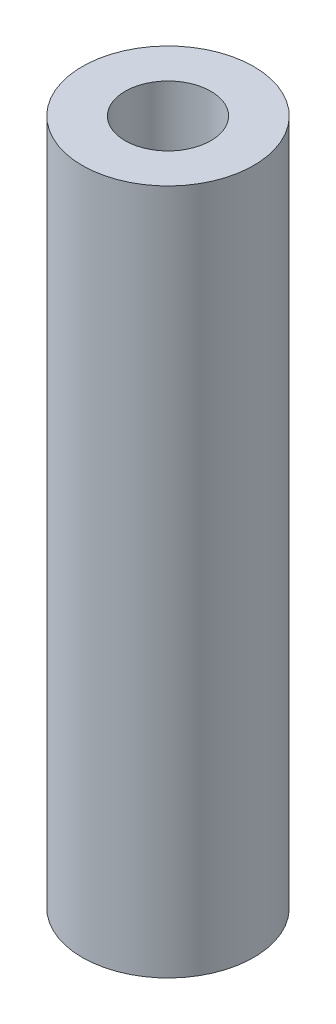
ISO-10303-21;
HEADER;
FILE_DESCRIPTION(('STEP AP214'),'2;1');
FILE_NAME('part.step','',(''),(''),'','','');
FILE_SCHEMA(('AUTOMOTIVE_DESIGN { 1 0 10303 214 1 1 1 1 }'));
ENDSEC;
DATA;
#1=APPLICATION_CONTEXT('core data for automotive mechanical design processes');
#2=APPLICATION_PROTOCOL_DEFINITION('international standard','automotive_design',2000,#1);
#3=PRODUCT_CONTEXT('',#1,'mechanical');
#4=PRODUCT('Part','Part','',(#3));
#5=PRODUCT_RELATED_PRODUCT_CATEGORY('part','',(#4));
#6=PRODUCT_DEFINITION_FORMATION('','',#4);
#7=PRODUCT_DEFINITION_CONTEXT('part definition',#1,'design');
#8=PRODUCT_DEFINITION('design','',#6,#7);
#9=PRODUCT_DEFINITION_SHAPE('','',#8);
#10=(LENGTH_UNIT() NAMED_UNIT(*) SI_UNIT(.MILLI.,.METRE.));
#11=(NAMED_UNIT(*) PLANE_ANGLE_UNIT() SI_UNIT($,.RADIAN.));
#12=(NAMED_UNIT(*) SI_UNIT($,.STERADIAN.) SOLID_ANGLE_UNIT());
#13=UNCERTAINTY_MEASURE_WITH_UNIT(LENGTH_MEASURE(1.E-05),#10,'distance_accuracy_value','');
#14=(GEOMETRIC_REPRESENTATION_CONTEXT(3) GLOBAL_UNCERTAINTY_ASSIGNED_CONTEXT((#13)) GLOBAL_UNIT_ASSIGNED_CONTEXT((#10,
#11,#12)) REPRESENTATION_CONTEXT('',''));
#15=CARTESIAN_POINT('',(0.,0.,0.));
#16=DIRECTION('',(0.,0.,1.));
#17=DIRECTION('',(1.,0.,0.));
#18=AXIS2_PLACEMENT_3D('',#15,#16,#17);
#19=CARTESIAN_POINT('',(0.,0.,0.));
#20=DIRECTION('',(0.,1.,0.));
#21=DIRECTION('',(0.,0.,1.));
#22=AXIS2_PLACEMENT_3D('',#19,#20,#21);
#23=CYLINDRICAL_SURFACE('',#22,3.175);
#24=CARTESIAN_POINT('',(0.,25.4,0.));
#25=DIRECTION('',(0.,1.,0.));
#26=DIRECTION('',(0.,0.,1.));
#27=AXIS2_PLACEMENT_3D('',#24,#25,#26);
#28=CIRCLE('',#27,3.175);
#29=CARTESIAN_POINT('',(0.,25.4,3.175));
#30=VERTEX_POINT('',#29);
#31=EDGE_CURVE('E53',#30,#30,#28,.T.);
#32=ORIENTED_EDGE('',*,*,#31,.F.);
#33=EDGE_LOOP('',(#32));
#34=FACE_BOUND('',#33,.T.);
#35=CARTESIAN_POINT('',(0.,0.,0.));
#36=DIRECTION('',(0.,1.,0.));
#37=DIRECTION('',(0.,0.,1.));
#38=AXIS2_PLACEMENT_3D('',#35,#36,#37);
#39=CIRCLE('',#38,3.175);
#40=CARTESIAN_POINT('',(0.,0.,3.175));
#41=VERTEX_POINT('',#40);
#42=EDGE_CURVE('E38',#41,#41,#39,.T.);
#43=ORIENTED_EDGE('',*,*,#42,.T.);
#44=EDGE_LOOP('',(#43));
#45=FACE_BOUND('',#44,.T.);
#46=ADVANCED_FACE('F35',(#34,#45),#23,.T.);
#47=CARTESIAN_POINT('',(0.,0.,0.));
#48=DIRECTION('',(0.,1.,0.));
#49=DIRECTION('',(0.,0.,1.));
#50=AXIS2_PLACEMENT_3D('',#47,#48,#49);
#51=PLANE('',#50);
#52=CARTESIAN_POINT('',(0.,0.,0.));
#53=DIRECTION('',(0.,1.,0.));
#54=DIRECTION('',(0.,0.,1.));
#55=AXIS2_PLACEMENT_3D('',#52,#53,#54);
#56=CIRCLE('',#55,1.5875);
#57=CARTESIAN_POINT('',(0.,0.,1.5875));
#58=VERTEX_POINT('',#57);
#59=EDGE_CURVE('E43',#58,#58,#56,.F.);
#60=ORIENTED_EDGE('',*,*,#59,.F.);
#61=EDGE_LOOP('',(#60));
#62=FACE_BOUND('',#61,.T.);
#63=ORIENTED_EDGE('',*,*,#42,.F.);
#64=EDGE_LOOP('',(#63));
#65=FACE_BOUND('',#64,.T.);
#66=ADVANCED_FACE('F71',(#62,#65),#51,.F.);
#67=CARTESIAN_POINT('',(0.,25.4,0.));
#68=DIRECTION('',(0.,1.,0.));
#69=DIRECTION('',(0.,0.,1.));
#70=AXIS2_PLACEMENT_3D('',#67,#68,#69);
#71=PLANE('',#70);
#72=CARTESIAN_POINT('',(0.,25.4,0.));
#73=DIRECTION('',(0.,1.,0.));
#74=DIRECTION('',(0.,0.,1.));
#75=AXIS2_PLACEMENT_3D('',#72,#73,#74);
#76=CIRCLE('',#75,1.5875);
#77=CARTESIAN_POINT('',(0.,25.4,1.5875));
#78=VERTEX_POINT('',#77);
#79=EDGE_CURVE('E11',#78,#78,#76,.F.);
#80=ORIENTED_EDGE('',*,*,#79,.T.);
#81=EDGE_LOOP('',(#80));
#82=FACE_BOUND('',#81,.T.);
#83=ORIENTED_EDGE('',*,*,#31,.T.);
#84=EDGE_LOOP('',(#83));
#85=FACE_BOUND('',#84,.T.);
#86=ADVANCED_FACE('F60',(#82,#85),#71,.T.);
#87=CARTESIAN_POINT('',(0.,0.,0.));
#88=DIRECTION('',(0.,1.,0.));
#89=DIRECTION('',(0.,0.,1.));
#90=AXIS2_PLACEMENT_3D('',#87,#88,#89);
#91=CYLINDRICAL_SURFACE('',#90,1.5875);
#92=ORIENTED_EDGE('',*,*,#79,.F.);
#93=EDGE_LOOP('',(#92));
#94=FACE_BOUND('',#93,.T.);
#95=ORIENTED_EDGE('',*,*,#59,.T.);
#96=EDGE_LOOP('',(#95));
#97=FACE_BOUND('',#96,.T.);
#98=ADVANCED_FACE('F63',(#94,#97),#91,.F.);
#99=CLOSED_SHELL('',(#46,#66,#86,#98));
#100=MANIFOLD_SOLID_BREP('B2',#99);
#101=ADVANCED_BREP_SHAPE_REPRESENTATION('',(#18,#100),#14);
#102=SHAPE_DEFINITION_REPRESENTATION(#9,#101);
ENDSEC;
END-ISO-10303-21;
